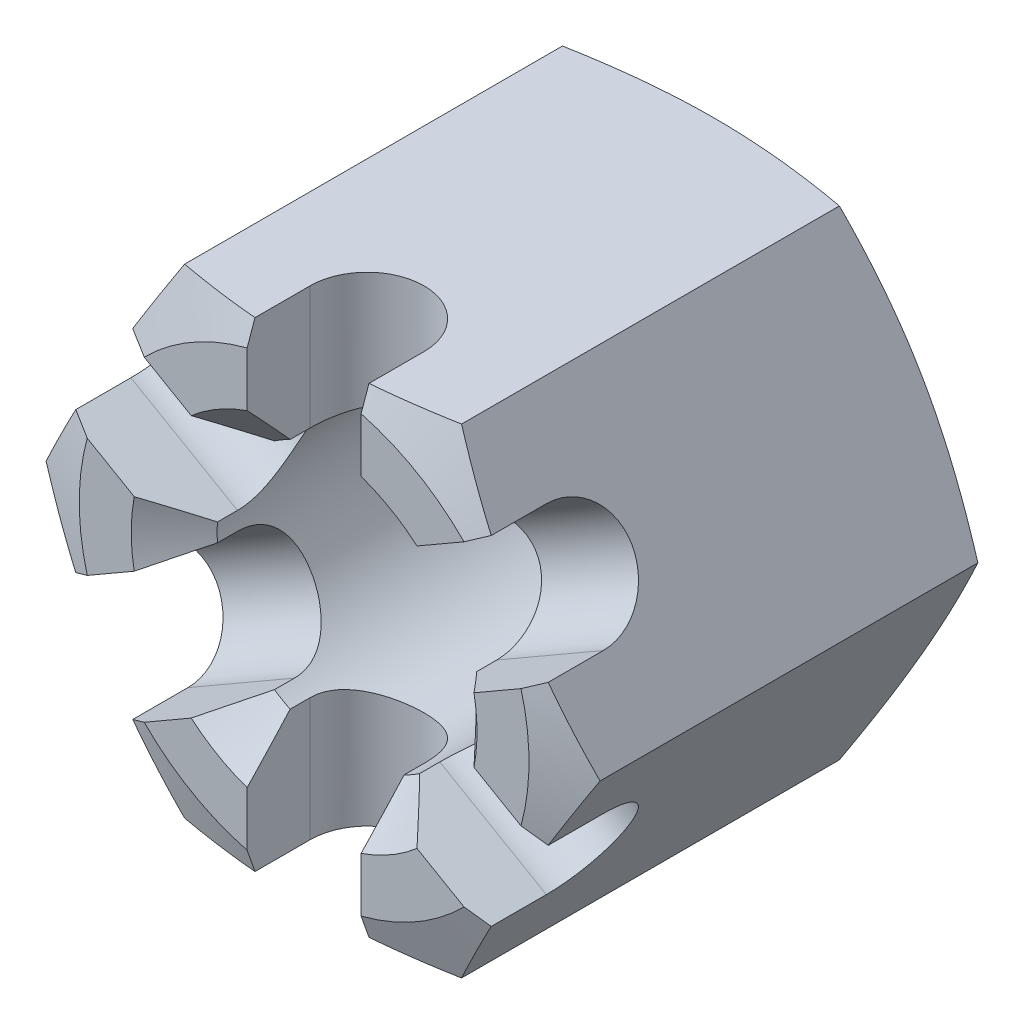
from build123d import *

# Parameters (mm, degrees)
BASENUT_DEPTH     = 20.8
SKETCH3_R         = 6.5
HOLE_DEPTH        = 31.825873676
SLOT_DEPTH        = 39.248765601
SLOTPATTERN_COUNT = 6


with BuildPart() as part:
    # Sketch1 → BaseNut (new body)
    with BuildSketch(Plane.XY):
        Polygon((6.92820323, -12), (13.856406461, 0), (6.92820323, 12), (-6.92820323, 12), (-13.856406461, 0), (-6.92820323, -12), align=None)
    extrude(amount=-BASENUT_DEPTH)

    # Sketch2 → Double-Chamfer (revolve, cut)
    with BuildSketch(Plane(origin=(-3.47179677, 0, -17.32820323), x_dir=(0, 0, -1), z_dir=(0, 1, 0))):
        Polygon((3.47179677, 7.77820323), (2.5231424, 10.384609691), (3.47179677, 10.384609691), align=None)
        Polygon((-17.32820323, 7.77820323), (-17.32820323, 10.384609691), (-16.37954886, 10.384609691), align=None)
    revolve(axis=Axis((0, 0, -17.32820323), (0, 0, 1)), mode=Mode.SUBTRACT)

    # Sketch3 → Hole (cut, through all)
    with BuildSketch(Plane(origin=(-4.279914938, -1.735659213, -20.8), x_dir=(-1, 0, 0), z_dir=(0, 0, -1))):
        with Locations((-4.279914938, 1.735659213)):
            Circle(SKETCH3_R)
    extrude(amount=-HOLE_DEPTH, mode=Mode.SUBTRACT)

    # Sketch4 → EndChamfer (revolve, cut)
    with BuildSketch(Plane(origin=(-15.758283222, 0, -7.108283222), x_dir=(0, 0, -1), z_dir=(0, 1, 0)), mode=Mode.PRIVATE) as endchamfer_sk:
        Polygon((13.691716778, -24.408283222), (11.541716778, -22.258283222), (13.691716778, -22.258283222), align=None)
        Polygon((-7.108283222, -22.258283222), (-4.958283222, -22.258283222), (-7.108283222, -24.408283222), align=None)
    revolve(endchamfer_sk.sketch.rotate(Axis((0, 0, -7.108283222), (0, 0, 1)), 180), axis=Axis((0, 0, -7.108283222), (0, 0, 1)), mode=Mode.SUBTRACT)

    # Sketch5 → Slot (cut, through all)
    with BuildSketch(Plane(origin=(-17.8, 0, -17.8), x_dir=(0, 0, -1), z_dir=(0, 1, 0))):
        with BuildLine():
            Line((-17.8, -14.95), (-14.65, -14.95))
            ThreePointArc((-14.65, -14.95), (-11.8, -17.8), (-14.65, -20.65))
            Line((-14.65, -20.65), (-17.8, -20.65))
            Line((-17.8, -20.65), (-17.8, -14.95))
        make_face()
    slot = extrude(amount=-SLOT_DEPTH, mode=Mode.SUBTRACT)

    # SlotPattern: Slot ×6 about axis
    slotpattern_axis = Axis((0, 0, 0), (0, 0, 1))
    for i in range(1, SLOTPATTERN_COUNT):
        add(slot.rotate(slotpattern_axis, i * 360 / SLOTPATTERN_COUNT), mode=Mode.SUBTRACT)


solid = part.part
